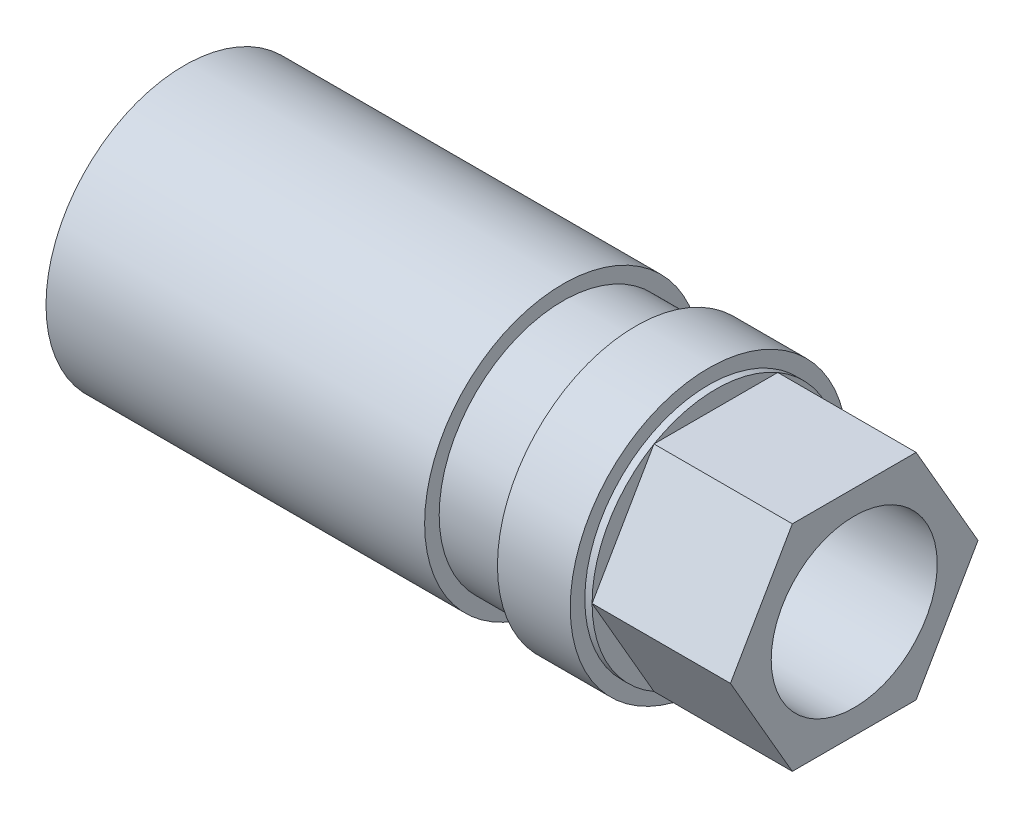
ISO-10303-21;
HEADER;
FILE_DESCRIPTION(('STEP AP214'),'2;1');
FILE_NAME('part.step','',(''),(''),'','','');
FILE_SCHEMA(('AUTOMOTIVE_DESIGN { 1 0 10303 214 1 1 1 1 }'));
ENDSEC;
DATA;
#1=APPLICATION_CONTEXT('core data for automotive mechanical design processes');
#2=APPLICATION_PROTOCOL_DEFINITION('international standard','automotive_design',2000,#1);
#3=PRODUCT_CONTEXT('',#1,'mechanical');
#4=PRODUCT('Part','Part','',(#3));
#5=PRODUCT_RELATED_PRODUCT_CATEGORY('part','',(#4));
#6=PRODUCT_DEFINITION_FORMATION('','',#4);
#7=PRODUCT_DEFINITION_CONTEXT('part definition',#1,'design');
#8=PRODUCT_DEFINITION('design','',#6,#7);
#9=PRODUCT_DEFINITION_SHAPE('','',#8);
#10=(LENGTH_UNIT() NAMED_UNIT(*) SI_UNIT(.MILLI.,.METRE.));
#11=(NAMED_UNIT(*) PLANE_ANGLE_UNIT() SI_UNIT($,.RADIAN.));
#12=(NAMED_UNIT(*) SI_UNIT($,.STERADIAN.) SOLID_ANGLE_UNIT());
#13=UNCERTAINTY_MEASURE_WITH_UNIT(LENGTH_MEASURE(1.E-05),#10,'distance_accuracy_value','');
#14=(GEOMETRIC_REPRESENTATION_CONTEXT(3) GLOBAL_UNCERTAINTY_ASSIGNED_CONTEXT((#13)) GLOBAL_UNIT_ASSIGNED_CONTEXT((#10,
#11,#12)) REPRESENTATION_CONTEXT('',''));
#15=CARTESIAN_POINT('',(0.,0.,0.));
#16=DIRECTION('',(0.,0.,1.));
#17=DIRECTION('',(1.,0.,0.));
#18=AXIS2_PLACEMENT_3D('',#15,#16,#17);
#19=CARTESIAN_POINT('',(36.5,8.5,0.));
#20=DIRECTION('',(-1.,0.,0.));
#21=DIRECTION('',(0.,0.,1.));
#22=AXIS2_PLACEMENT_3D('',#19,#20,#21);
#23=PLANE('',#22);
#24=DIRECTION('',(0.,1.33887964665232E-05,0.99999999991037));
#25=VECTOR('',#24,1.);
#26=CARTESIAN_POINT('',(36.5,7.36115902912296,-4.25009855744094));
#27=LINE('',#26,#25);
#28=CARTESIAN_POINT('',(36.5,7.36115902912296,-4.25009855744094));
#29=VERTEX_POINT('',#28);
#30=CARTESIAN_POINT('',(36.5,7.36127283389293,4.24990144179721));
#31=VERTEX_POINT('',#30);
#32=EDGE_CURVE('E111',#29,#31,#27,.T.);
#33=ORIENTED_EDGE('',*,*,#32,.F.);
#34=CARTESIAN_POINT('',(36.5,0.,0.));
#35=DIRECTION('',(-1.,0.,0.));
#36=DIRECTION('',(0.,0.,1.));
#37=AXIS2_PLACEMENT_3D('',#34,#35,#36);
#38=CIRCLE('',#37,8.5);
#39=EDGE_CURVE('E124',#31,#29,#38,.T.);
#40=ORIENTED_EDGE('',*,*,#39,.F.);
#41=EDGE_LOOP('',(#33,#40));
#42=FACE_BOUND('',#41,.T.);
#43=ADVANCED_FACE('F33',(#42),#23,.F.);
#44=DIRECTION('',(0.,0.86603209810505,0.499988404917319));
#45=VECTOR('',#44,1.);
#46=CARTESIAN_POINT('',(36.5,-0.00011380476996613,-8.49999999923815));
#47=LINE('',#46,#45);
#48=CARTESIAN_POINT('',(36.5,-0.000113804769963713,-8.49999999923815));
#49=VERTEX_POINT('',#48);
#50=EDGE_CURVE('E108',#49,#29,#47,.T.);
#51=ORIENTED_EDGE('',*,*,#50,.F.);
#52=EDGE_CURVE('E190',#29,#49,#38,.T.);
#53=ORIENTED_EDGE('',*,*,#52,.F.);
#54=EDGE_LOOP('',(#51,#53));
#55=FACE_BOUND('',#54,.T.);
#56=ADVANCED_FACE('F248',(#55),#23,.F.);
#57=DIRECTION('',(0.,0.866018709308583,-0.500011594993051));
#58=VECTOR('',#57,1.);
#59=CARTESIAN_POINT('',(36.5,-7.36127283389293,-4.24990144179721));
#60=LINE('',#59,#58);
#61=CARTESIAN_POINT('',(36.5,-7.36127283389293,-4.24990144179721));
#62=VERTEX_POINT('',#61);
#63=EDGE_CURVE('E54',#62,#49,#60,.T.);
#64=ORIENTED_EDGE('',*,*,#63,.F.);
#65=EDGE_CURVE('E191',#49,#62,#38,.T.);
#66=ORIENTED_EDGE('',*,*,#65,.F.);
#67=EDGE_LOOP('',(#64,#66));
#68=FACE_BOUND('',#67,.T.);
#69=ADVANCED_FACE('F253',(#68),#23,.F.);
#70=DIRECTION('',(0.,-1.33887964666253E-05,-0.99999999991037));
#71=VECTOR('',#70,1.);
#72=CARTESIAN_POINT('',(36.5,-7.36115902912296,4.25009855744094));
#73=LINE('',#72,#71);
#74=CARTESIAN_POINT('',(36.5,-7.36115902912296,4.25009855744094));
#75=VERTEX_POINT('',#74);
#76=EDGE_CURVE('E47',#75,#62,#73,.T.);
#77=ORIENTED_EDGE('',*,*,#76,.F.);
#78=EDGE_CURVE('E115',#62,#75,#38,.T.);
#79=ORIENTED_EDGE('',*,*,#78,.F.);
#80=EDGE_LOOP('',(#77,#79));
#81=FACE_BOUND('',#80,.T.);
#82=ADVANCED_FACE('F263',(#81),#23,.F.);
#83=DIRECTION('',(0.,-0.86603209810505,-0.499988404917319));
#84=VECTOR('',#83,1.);
#85=CARTESIAN_POINT('',(36.5,0.000113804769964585,8.49999999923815));
#86=LINE('',#85,#84);
#87=CARTESIAN_POINT('',(36.5,0.000113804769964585,8.49999999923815));
#88=VERTEX_POINT('',#87);
#89=EDGE_CURVE('E186',#88,#75,#86,.T.);
#90=ORIENTED_EDGE('',*,*,#89,.F.);
#91=EDGE_CURVE('E112',#75,#88,#38,.T.);
#92=ORIENTED_EDGE('',*,*,#91,.F.);
#93=EDGE_LOOP('',(#90,#92));
#94=FACE_BOUND('',#93,.T.);
#95=ADVANCED_FACE('F257',(#94),#23,.F.);
#96=DIRECTION('',(0.,-0.866018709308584,0.500011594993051));
#97=VECTOR('',#96,1.);
#98=CARTESIAN_POINT('',(36.5,7.36127283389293,4.24990144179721));
#99=LINE('',#98,#97);
#100=EDGE_CURVE('E185',#31,#88,#99,.T.);
#101=ORIENTED_EDGE('',*,*,#100,.F.);
#102=EDGE_CURVE('E117',#88,#31,#38,.T.);
#103=ORIENTED_EDGE('',*,*,#102,.F.);
#104=EDGE_LOOP('',(#101,#103));
#105=FACE_BOUND('',#104,.T.);
#106=ADVANCED_FACE('F184',(#105),#23,.F.);
#107=CARTESIAN_POINT('',(0.,0.,0.));
#108=DIRECTION('',(1.,0.,0.));
#109=DIRECTION('',(0.,0.,-1.));
#110=AXIS2_PLACEMENT_3D('',#107,#108,#109);
#111=PLANE('',#110);
#112=CARTESIAN_POINT('',(0.,0.,0.));
#113=DIRECTION('',(-1.,0.,0.));
#114=DIRECTION('',(0.,0.,1.));
#115=AXIS2_PLACEMENT_3D('',#112,#113,#114);
#116=CIRCLE('',#115,9.5);
#117=CARTESIAN_POINT('',(0.,0.,9.5));
#118=VERTEX_POINT('',#117);
#119=EDGE_CURVE('E11',#118,#118,#116,.T.);
#120=ORIENTED_EDGE('',*,*,#119,.T.);
#121=EDGE_LOOP('',(#120));
#122=FACE_BOUND('',#121,.T.);
#123=ADVANCED_FACE('F35',(#122),#111,.F.);
#124=CARTESIAN_POINT('',(0.,0.,0.));
#125=DIRECTION('',(-1.,0.,0.));
#126=DIRECTION('',(0.,0.,1.));
#127=AXIS2_PLACEMENT_3D('',#124,#125,#126);
#128=CYLINDRICAL_SURFACE('',#127,9.5);
#129=ORIENTED_EDGE('',*,*,#119,.F.);
#130=EDGE_LOOP('',(#129));
#131=FACE_BOUND('',#130,.T.);
#132=CARTESIAN_POINT('',(26.,0.,0.));
#133=DIRECTION('',(-1.,0.,0.));
#134=DIRECTION('',(0.,0.,1.));
#135=AXIS2_PLACEMENT_3D('',#132,#133,#134);
#136=CIRCLE('',#135,9.5);
#137=CARTESIAN_POINT('',(26.,0.,9.5));
#138=VERTEX_POINT('',#137);
#139=EDGE_CURVE('E41',#138,#138,#136,.T.);
#140=ORIENTED_EDGE('',*,*,#139,.T.);
#141=EDGE_LOOP('',(#140));
#142=FACE_BOUND('',#141,.T.);
#143=ADVANCED_FACE('F141',(#131,#142),#128,.T.);
#144=CARTESIAN_POINT('',(26.,9.5,0.));
#145=DIRECTION('',(-1.,0.,0.));
#146=DIRECTION('',(0.,0.,1.));
#147=AXIS2_PLACEMENT_3D('',#144,#145,#146);
#148=PLANE('',#147);
#149=ORIENTED_EDGE('',*,*,#139,.F.);
#150=EDGE_LOOP('',(#149));
#151=FACE_BOUND('',#150,.T.);
#152=CARTESIAN_POINT('',(26.,0.,0.));
#153=DIRECTION('',(-1.,0.,0.));
#154=DIRECTION('',(0.,0.,1.));
#155=AXIS2_PLACEMENT_3D('',#152,#153,#154);
#156=CIRCLE('',#155,8.5);
#157=CARTESIAN_POINT('',(26.,0.,8.5));
#158=VERTEX_POINT('',#157);
#159=EDGE_CURVE('E136',#158,#158,#156,.T.);
#160=ORIENTED_EDGE('',*,*,#159,.T.);
#161=EDGE_LOOP('',(#160));
#162=FACE_BOUND('',#161,.T.);
#163=ADVANCED_FACE('F143',(#151,#162),#148,.F.);
#164=CARTESIAN_POINT('',(0.,0.,0.));
#165=DIRECTION('',(-1.,0.,0.));
#166=DIRECTION('',(0.,0.,1.));
#167=AXIS2_PLACEMENT_3D('',#164,#165,#166);
#168=CYLINDRICAL_SURFACE('',#167,8.5);
#169=ORIENTED_EDGE('',*,*,#159,.F.);
#170=EDGE_LOOP('',(#169));
#171=FACE_BOUND('',#170,.T.);
#172=CARTESIAN_POINT('',(31.,0.,0.));
#173=DIRECTION('',(-1.,0.,0.));
#174=DIRECTION('',(0.,0.,1.));
#175=AXIS2_PLACEMENT_3D('',#172,#173,#174);
#176=CIRCLE('',#175,8.5);
#177=CARTESIAN_POINT('',(31.,0.,8.5));
#178=VERTEX_POINT('',#177);
#179=EDGE_CURVE('E133',#178,#178,#176,.T.);
#180=ORIENTED_EDGE('',*,*,#179,.T.);
#181=EDGE_LOOP('',(#180));
#182=FACE_BOUND('',#181,.T.);
#183=ADVANCED_FACE('F146',(#171,#182),#168,.T.);
#184=CARTESIAN_POINT('',(31.,8.5,0.));
#185=DIRECTION('',(1.,0.,0.));
#186=DIRECTION('',(0.,0.,-1.));
#187=AXIS2_PLACEMENT_3D('',#184,#185,#186);
#188=PLANE('',#187);
#189=ORIENTED_EDGE('',*,*,#179,.F.);
#190=EDGE_LOOP('',(#189));
#191=FACE_BOUND('',#190,.T.);
#192=CARTESIAN_POINT('',(31.,0.,0.));
#193=DIRECTION('',(-1.,0.,0.));
#194=DIRECTION('',(0.,0.,1.));
#195=AXIS2_PLACEMENT_3D('',#192,#193,#194);
#196=CIRCLE('',#195,9.5);
#197=CARTESIAN_POINT('',(31.,0.,9.5));
#198=VERTEX_POINT('',#197);
#199=EDGE_CURVE('E130',#198,#198,#196,.T.);
#200=ORIENTED_EDGE('',*,*,#199,.T.);
#201=EDGE_LOOP('',(#200));
#202=FACE_BOUND('',#201,.T.);
#203=ADVANCED_FACE('F152',(#191,#202),#188,.F.);
#204=CARTESIAN_POINT('',(0.,0.,0.));
#205=DIRECTION('',(-1.,0.,0.));
#206=DIRECTION('',(0.,0.,1.));
#207=AXIS2_PLACEMENT_3D('',#204,#205,#206);
#208=CYLINDRICAL_SURFACE('',#207,9.5);
#209=ORIENTED_EDGE('',*,*,#199,.F.);
#210=EDGE_LOOP('',(#209));
#211=FACE_BOUND('',#210,.T.);
#212=CARTESIAN_POINT('',(36.,0.,0.));
#213=DIRECTION('',(-1.,0.,0.));
#214=DIRECTION('',(0.,0.,1.));
#215=AXIS2_PLACEMENT_3D('',#212,#213,#214);
#216=CIRCLE('',#215,9.5);
#217=CARTESIAN_POINT('',(36.,0.,9.5));
#218=VERTEX_POINT('',#217);
#219=EDGE_CURVE('E127',#218,#218,#216,.T.);
#220=ORIENTED_EDGE('',*,*,#219,.T.);
#221=EDGE_LOOP('',(#220));
#222=FACE_BOUND('',#221,.T.);
#223=ADVANCED_FACE('F158',(#211,#222),#208,.T.);
#224=CARTESIAN_POINT('',(36.,9.5,0.));
#225=DIRECTION('',(-1.,0.,0.));
#226=DIRECTION('',(0.,0.,1.));
#227=AXIS2_PLACEMENT_3D('',#224,#225,#226);
#228=PLANE('',#227);
#229=ORIENTED_EDGE('',*,*,#219,.F.);
#230=EDGE_LOOP('',(#229));
#231=FACE_BOUND('',#230,.T.);
#232=CARTESIAN_POINT('',(36.,0.,0.));
#233=DIRECTION('',(-1.,0.,0.));
#234=DIRECTION('',(0.,0.,1.));
#235=AXIS2_PLACEMENT_3D('',#232,#233,#234);
#236=CIRCLE('',#235,8.5);
#237=CARTESIAN_POINT('',(36.,0.,8.5));
#238=VERTEX_POINT('',#237);
#239=EDGE_CURVE('E123',#238,#238,#236,.T.);
#240=ORIENTED_EDGE('',*,*,#239,.T.);
#241=EDGE_LOOP('',(#240));
#242=FACE_BOUND('',#241,.T.);
#243=ADVANCED_FACE('F164',(#231,#242),#228,.F.);
#244=CARTESIAN_POINT('',(0.,0.,0.));
#245=DIRECTION('',(-1.,0.,0.));
#246=DIRECTION('',(0.,0.,1.));
#247=AXIS2_PLACEMENT_3D('',#244,#245,#246);
#248=CYLINDRICAL_SURFACE('',#247,8.5);
#249=ORIENTED_EDGE('',*,*,#239,.F.);
#250=EDGE_LOOP('',(#249));
#251=FACE_BOUND('',#250,.T.);
#252=ORIENTED_EDGE('',*,*,#102,.T.);
#253=ORIENTED_EDGE('',*,*,#39,.T.);
#254=ORIENTED_EDGE('',*,*,#52,.T.);
#255=ORIENTED_EDGE('',*,*,#65,.T.);
#256=ORIENTED_EDGE('',*,*,#78,.T.);
#257=ORIENTED_EDGE('',*,*,#91,.T.);
#258=EDGE_LOOP('',(#252,#253,#254,#255,#256,#257));
#259=FACE_BOUND('',#258,.T.);
#260=ADVANCED_FACE('F170',(#251,#259),#248,.T.);
#261=CARTESIAN_POINT('',(46.,7.36115902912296,-4.25009855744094));
#262=DIRECTION('',(0.,-0.99999999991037,1.33887964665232E-05));
#263=DIRECTION('',(0.,-1.33887964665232E-05,-0.99999999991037));
#264=AXIS2_PLACEMENT_3D('',#261,#262,#263);
#265=PLANE('',#264);
#266=ORIENTED_EDGE('',*,*,#32,.T.);
#267=DIRECTION('',(-1.,0.,0.));
#268=VECTOR('',#267,1.);
#269=CARTESIAN_POINT('',(46.,7.36127283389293,4.24990144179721));
#270=LINE('',#269,#268);
#271=CARTESIAN_POINT('',(46.,7.36127283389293,4.24990144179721));
#272=VERTEX_POINT('',#271);
#273=EDGE_CURVE('E92',#272,#31,#270,.T.);
#274=ORIENTED_EDGE('',*,*,#273,.F.);
#275=DIRECTION('',(0.,1.33887964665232E-05,0.99999999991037));
#276=VECTOR('',#275,1.);
#277=CARTESIAN_POINT('',(46.,7.36115902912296,-4.25009855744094));
#278=LINE('',#277,#276);
#279=CARTESIAN_POINT('',(46.,7.36115902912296,-4.25009855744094));
#280=VERTEX_POINT('',#279);
#281=EDGE_CURVE('E99',#280,#272,#278,.T.);
#282=ORIENTED_EDGE('',*,*,#281,.F.);
#283=DIRECTION('',(-1.,0.,0.));
#284=VECTOR('',#283,1.);
#285=CARTESIAN_POINT('',(46.,7.36115902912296,-4.25009855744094));
#286=LINE('',#285,#284);
#287=EDGE_CURVE('E212',#280,#29,#286,.T.);
#288=ORIENTED_EDGE('',*,*,#287,.T.);
#289=EDGE_LOOP('',(#266,#274,#282,#288));
#290=FACE_BOUND('',#289,.T.);
#291=ADVANCED_FACE('F110',(#290),#265,.F.);
#292=CARTESIAN_POINT('',(46.,7.36127283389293,4.24990144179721));
#293=DIRECTION('',(0.,-0.500011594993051,-0.866018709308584));
#294=DIRECTION('',(0.,0.866018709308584,-0.500011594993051));
#295=AXIS2_PLACEMENT_3D('',#292,#293,#294);
#296=PLANE('',#295);
#297=ORIENTED_EDGE('',*,*,#100,.T.);
#298=DIRECTION('',(-1.,0.,0.));
#299=VECTOR('',#298,1.);
#300=CARTESIAN_POINT('',(46.,0.000113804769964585,8.49999999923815));
#301=LINE('',#300,#299);
#302=CARTESIAN_POINT('',(46.,0.000113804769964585,8.49999999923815));
#303=VERTEX_POINT('',#302);
#304=EDGE_CURVE('E95',#303,#88,#301,.T.);
#305=ORIENTED_EDGE('',*,*,#304,.F.);
#306=DIRECTION('',(0.,-0.866018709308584,0.500011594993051));
#307=VECTOR('',#306,1.);
#308=CARTESIAN_POINT('',(46.,7.36127283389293,4.24990144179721));
#309=LINE('',#308,#307);
#310=EDGE_CURVE('E87',#272,#303,#309,.T.);
#311=ORIENTED_EDGE('',*,*,#310,.F.);
#312=ORIENTED_EDGE('',*,*,#273,.T.);
#313=EDGE_LOOP('',(#297,#305,#311,#312));
#314=FACE_BOUND('',#313,.T.);
#315=ADVANCED_FACE('F90',(#314),#296,.F.);
#316=CARTESIAN_POINT('',(46.,0.000113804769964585,8.49999999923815));
#317=DIRECTION('',(0.,0.499988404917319,-0.86603209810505));
#318=DIRECTION('',(0.,0.86603209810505,0.499988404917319));
#319=AXIS2_PLACEMENT_3D('',#316,#317,#318);
#320=PLANE('',#319);
#321=ORIENTED_EDGE('',*,*,#89,.T.);
#322=DIRECTION('',(-1.,0.,0.));
#323=VECTOR('',#322,1.);
#324=CARTESIAN_POINT('',(46.,-7.36115902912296,4.25009855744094));
#325=LINE('',#324,#323);
#326=CARTESIAN_POINT('',(46.,-7.36115902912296,4.25009855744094));
#327=VERTEX_POINT('',#326);
#328=EDGE_CURVE('E118',#327,#75,#325,.T.);
#329=ORIENTED_EDGE('',*,*,#328,.F.);
#330=DIRECTION('',(0.,-0.86603209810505,-0.499988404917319));
#331=VECTOR('',#330,1.);
#332=CARTESIAN_POINT('',(46.,0.000113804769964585,8.49999999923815));
#333=LINE('',#332,#331);
#334=EDGE_CURVE('E98',#303,#327,#333,.T.);
#335=ORIENTED_EDGE('',*,*,#334,.F.);
#336=ORIENTED_EDGE('',*,*,#304,.T.);
#337=EDGE_LOOP('',(#321,#329,#335,#336));
#338=FACE_BOUND('',#337,.T.);
#339=ADVANCED_FACE('F197',(#338),#320,.F.);
#340=CARTESIAN_POINT('',(46.,-7.36115902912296,4.25009855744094));
#341=DIRECTION('',(0.,0.99999999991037,-1.33887964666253E-05));
#342=DIRECTION('',(0.,1.33887964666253E-05,0.99999999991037));
#343=AXIS2_PLACEMENT_3D('',#340,#341,#342);
#344=PLANE('',#343);
#345=ORIENTED_EDGE('',*,*,#76,.T.);
#346=DIRECTION('',(-1.,0.,0.));
#347=VECTOR('',#346,1.);
#348=CARTESIAN_POINT('',(46.,-7.36127283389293,-4.24990144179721));
#349=LINE('',#348,#347);
#350=CARTESIAN_POINT('',(46.,-7.36127283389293,-4.24990144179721));
#351=VERTEX_POINT('',#350);
#352=EDGE_CURVE('E206',#351,#62,#349,.T.);
#353=ORIENTED_EDGE('',*,*,#352,.F.);
#354=DIRECTION('',(0.,-1.33887964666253E-05,-0.99999999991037));
#355=VECTOR('',#354,1.);
#356=CARTESIAN_POINT('',(46.,-7.36115902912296,4.25009855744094));
#357=LINE('',#356,#355);
#358=EDGE_CURVE('E205',#327,#351,#357,.T.);
#359=ORIENTED_EDGE('',*,*,#358,.F.);
#360=ORIENTED_EDGE('',*,*,#328,.T.);
#361=EDGE_LOOP('',(#345,#353,#359,#360));
#362=FACE_BOUND('',#361,.T.);
#363=ADVANCED_FACE('F202',(#362),#344,.F.);
#364=CARTESIAN_POINT('',(46.,-7.36127283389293,-4.24990144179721));
#365=DIRECTION('',(0.,0.500011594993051,0.866018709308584));
#366=DIRECTION('',(0.,-0.866018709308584,0.500011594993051));
#367=AXIS2_PLACEMENT_3D('',#364,#365,#366);
#368=PLANE('',#367);
#369=ORIENTED_EDGE('',*,*,#63,.T.);
#370=DIRECTION('',(-1.,0.,0.));
#371=VECTOR('',#370,1.);
#372=CARTESIAN_POINT('',(46.,-0.00011380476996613,-8.49999999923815));
#373=LINE('',#372,#371);
#374=CARTESIAN_POINT('',(46.,-0.00011380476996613,-8.49999999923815));
#375=VERTEX_POINT('',#374);
#376=EDGE_CURVE('E207',#375,#49,#373,.T.);
#377=ORIENTED_EDGE('',*,*,#376,.F.);
#378=DIRECTION('',(0.,0.866018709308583,-0.500011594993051));
#379=VECTOR('',#378,1.);
#380=CARTESIAN_POINT('',(46.,-7.36127283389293,-4.24990144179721));
#381=LINE('',#380,#379);
#382=EDGE_CURVE('E220',#351,#375,#381,.T.);
#383=ORIENTED_EDGE('',*,*,#382,.F.);
#384=ORIENTED_EDGE('',*,*,#352,.T.);
#385=EDGE_LOOP('',(#369,#377,#383,#384));
#386=FACE_BOUND('',#385,.T.);
#387=ADVANCED_FACE('F244',(#386),#368,.F.);
#388=CARTESIAN_POINT('',(46.,-0.00011380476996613,-8.49999999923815));
#389=DIRECTION('',(0.,-0.499988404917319,0.86603209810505));
#390=DIRECTION('',(0.,-0.86603209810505,-0.499988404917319));
#391=AXIS2_PLACEMENT_3D('',#388,#389,#390);
#392=PLANE('',#391);
#393=ORIENTED_EDGE('',*,*,#50,.T.);
#394=ORIENTED_EDGE('',*,*,#287,.F.);
#395=DIRECTION('',(0.,0.86603209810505,0.499988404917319));
#396=VECTOR('',#395,1.);
#397=CARTESIAN_POINT('',(46.,-0.00011380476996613,-8.49999999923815));
#398=LINE('',#397,#396);
#399=EDGE_CURVE('E104',#375,#280,#398,.T.);
#400=ORIENTED_EDGE('',*,*,#399,.F.);
#401=ORIENTED_EDGE('',*,*,#376,.T.);
#402=EDGE_LOOP('',(#393,#394,#400,#401));
#403=FACE_BOUND('',#402,.T.);
#404=ADVANCED_FACE('F239',(#403),#392,.F.);
#405=CARTESIAN_POINT('',(46.,0.,0.));
#406=DIRECTION('',(1.,0.,0.));
#407=DIRECTION('',(0.,0.,-1.));
#408=AXIS2_PLACEMENT_3D('',#405,#406,#407);
#409=PLANE('',#408);
#410=CARTESIAN_POINT('',(46.,0.,0.));
#411=DIRECTION('',(1.,0.,0.));
#412=DIRECTION('',(0.,0.,-1.));
#413=AXIS2_PLACEMENT_3D('',#410,#411,#412);
#414=CIRCLE('',#413,5.7);
#415=CARTESIAN_POINT('',(46.,0.,-5.7));
#416=VERTEX_POINT('',#415);
#417=EDGE_CURVE('E224',#416,#416,#414,.T.);
#418=ORIENTED_EDGE('',*,*,#417,.F.);
#419=EDGE_LOOP('',(#418));
#420=FACE_BOUND('',#419,.T.);
#421=ORIENTED_EDGE('',*,*,#281,.T.);
#422=ORIENTED_EDGE('',*,*,#310,.T.);
#423=ORIENTED_EDGE('',*,*,#334,.T.);
#424=ORIENTED_EDGE('',*,*,#358,.T.);
#425=ORIENTED_EDGE('',*,*,#382,.T.);
#426=ORIENTED_EDGE('',*,*,#399,.T.);
#427=EDGE_LOOP('',(#421,#422,#423,#424,#425,#426));
#428=FACE_BOUND('',#427,.T.);
#429=ADVANCED_FACE('F102',(#420,#428),#409,.T.);
#430=CARTESIAN_POINT('',(36.5,0.,0.));
#431=DIRECTION('',(1.,0.,0.));
#432=DIRECTION('',(0.,0.,-1.));
#433=AXIS2_PLACEMENT_3D('',#430,#431,#432);
#434=CYLINDRICAL_SURFACE('',#433,5.7);
#435=CARTESIAN_POINT('',(36.5,0.,0.));
#436=DIRECTION('',(1.,0.,0.));
#437=DIRECTION('',(0.,0.,-1.));
#438=AXIS2_PLACEMENT_3D('',#435,#436,#437);
#439=CIRCLE('',#438,5.7);
#440=CARTESIAN_POINT('',(36.5,0.,-5.7));
#441=VERTEX_POINT('',#440);
#442=EDGE_CURVE('E218',#441,#441,#439,.T.);
#443=ORIENTED_EDGE('',*,*,#442,.F.);
#444=EDGE_LOOP('',(#443));
#445=FACE_BOUND('',#444,.T.);
#446=ORIENTED_EDGE('',*,*,#417,.T.);
#447=EDGE_LOOP('',(#446));
#448=FACE_BOUND('',#447,.T.);
#449=ADVANCED_FACE('F232',(#445,#448),#434,.F.);
#450=CARTESIAN_POINT('',(36.5,0.,0.));
#451=DIRECTION('',(1.,0.,0.));
#452=DIRECTION('',(0.,0.,-1.));
#453=AXIS2_PLACEMENT_3D('',#450,#451,#452);
#454=PLANE('',#453);
#455=ORIENTED_EDGE('',*,*,#442,.T.);
#456=EDGE_LOOP('',(#455));
#457=FACE_BOUND('',#456,.T.);
#458=ADVANCED_FACE('F230',(#457),#454,.T.);
#459=CLOSED_SHELL('',(#43,#56,#69,#82,#95,#106,#123,#143,#163,#183,#203,#223,#243,#260,#291,
#315,#339,#363,#387,#404,#429,#449,#458));
#460=MANIFOLD_SOLID_BREP('B2',#459);
#461=ADVANCED_BREP_SHAPE_REPRESENTATION('',(#18,#460),#14);
#462=SHAPE_DEFINITION_REPRESENTATION(#9,#461);
ENDSEC;
END-ISO-10303-21;
